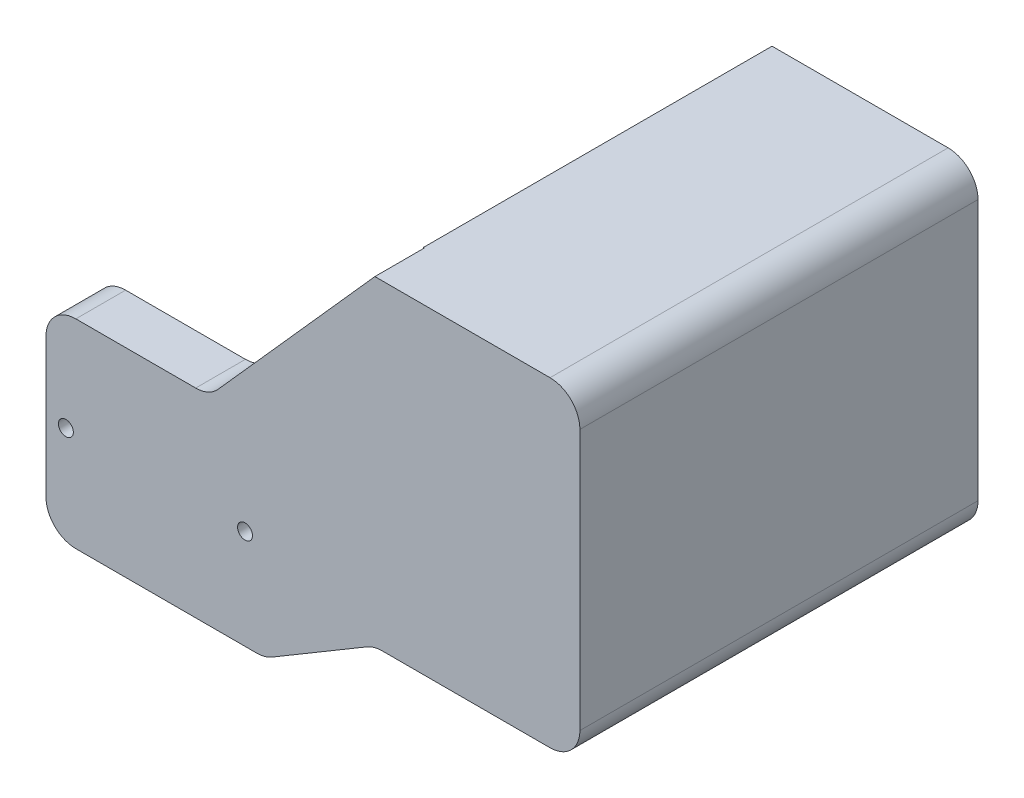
from build123d import *

# Parameters (mm, degrees)
CROQUIS1_W                 = 22
CROQUIS1_H                 = 20
SALIENTE_EXTRUIR1_DEPTH    = 30
SALIENTE_EXTRUIR1_2_DEPTH  = 30
CROQUIS3_W                 = 20.695436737
CROQUIS3_H                 = 32.204103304
SALIENTE_EXTRUIR2_DEPTH    = 5
CROQUIS4_W                 = 22
CROQUIS4_H                 = 20
CORTAR_EXTRUIR1_DEPTH      = 20
CROQUIS5_W                 = 22
CROQUIS5_H                 = 20
SALIENTE_EXTRUIR3_DEPTH    = 10
CROQUIS6_W                 = 22
CROQUIS6_H                 = 20
CORTAR_EXTRUIR2_DEPTH      = 10
CROQUIS7_W                 = 22
CROQUIS7_H                 = 20
CORTAR_EXTRUIR3_DEPTH      = 5
SALIENTE_EXTRUIR6_DEPTH    = 5
REDONDEO2_R                = 3
REDONDEO3_R                = 3
CROQUIS12_R                = 0.75
CORTAR_EXTRUIR4_DEPTH      = 7
REDONDEO4_R                = 3
REDONDEO5_R                = 3
REDONDEO6_R                = 3
REDONDEO7_R                = 3
REDONDEO8_R                = 3
CROQUIS13_R                = 0.75
SALIENTE_EXTRUIR7_DEPTH    = 5
CORTAR_EXTRUIR5_DEPTH      = 10
CORTAR_EXTRUIR5_DEPTH_BACK = 6
CROQUIS14_R                = 0.75
CROQUIS15_W                = 15.695436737
CROQUIS15_H                = 22.399714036
SALIENTE_EXTRUIR8_DEPTH    = 1.02
CROQUIS16_W                = 0.095436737
CROQUIS16_H                = 4.904389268
SALIENTE_EXTRUIR9_DEPTH    = 30.02


with BuildPart() as part:
    # Croquis1 → Saliente-Extruir1 (new body)
    with BuildSketch(Plane.XY):
        Rectangle(CROQUIS1_W, CROQUIS1_H)
    extrude(amount=-SALIENTE_EXTRUIR1_DEPTH)

    # Croquis4 → Cortar-Extruir1 (cut)
    with BuildSketch(Plane(origin=(0, 0, -30), x_dir=(-1, 0, 0), z_dir=(0, 0, -1))):
        Rectangle(CROQUIS4_W, CROQUIS4_H)
    extrude(amount=-CORTAR_EXTRUIR1_DEPTH, mode=Mode.SUBTRACT)

    # Croquis5 → Saliente-Extruir3 (add)
    with BuildSketch(Plane.XY):
        Rectangle(CROQUIS5_W, CROQUIS5_H)
    extrude(amount=SALIENTE_EXTRUIR3_DEPTH)

    # Croquis6 → Cortar-Extruir2 (cut)
    with BuildSketch(Plane(origin=(0, 0, -10), x_dir=(-1, 0, 0), z_dir=(0, 0, -1))):
        Rectangle(CROQUIS6_W, CROQUIS6_H)
    extrude(amount=-CORTAR_EXTRUIR2_DEPTH, mode=Mode.SUBTRACT)

    # Croquis7 → Cortar-Extruir3 (cut)
    with BuildSketch(Plane.XY.offset(10)):
        Rectangle(CROQUIS7_W, CROQUIS7_H)
    extrude(amount=-CORTAR_EXTRUIR3_DEPTH, mode=Mode.SUBTRACT)



with BuildPart() as body_2:
    # Croquis1 → Saliente-Extruir1 2 (new body)
    with BuildSketch(Plane.XY):
        Polygon((37.645436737, 1.4), (37.645436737, 23.799714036), (22.045436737, 23.799714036), (22.045436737, 28.704103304), (42.645436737, 28.704103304), (42.645436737, -3.5), (21.95, -3.5), (21.95, 1.4), align=None)
    extrude(amount=-SALIENTE_EXTRUIR1_2_DEPTH)

    # Croquis3 → Saliente-Extruir2 (add)
    with BuildSketch(Plane(origin=(0, 0, -30), x_dir=(-1, 0, 0), z_dir=(0, 0, -1))):
        with Locations((-32.297718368, 12.602051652)):
            Rectangle(CROQUIS3_W, CROQUIS3_H)
    extrude(amount=SALIENTE_EXTRUIR2_DEPTH)


with BuildPart() as part_1:
    add(part.part)

    add(body_2.part)  # Saliente-Extruir6 merges body 2
    # Croquis8 → Saliente-Extruir6 (add)
    with BuildSketch(Plane.XY.offset(5)):
        Polygon((11, -10), (11, -5.1), (11, 10), (5.385440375, 10), (22.045436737, 28.704103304), (42.645436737, 28.704103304), (42.645436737, -3.5), (21.95, -3.5), align=None)
    extrude(amount=-SALIENTE_EXTRUIR6_DEPTH)

    # Redondeo2
    redondeo2_edges = [part_1.edges().sort_by_distance(p)[0] for p in [
        (-11, 10, 2.5),
    ]]
    fillet(redondeo2_edges, radius=REDONDEO2_R)

    # Redondeo3
    redondeo3_edges = [part_1.edges().sort_by_distance(p)[0] for p in [
        (-11, -10, 2.5),
    ]]
    fillet(redondeo3_edges, radius=REDONDEO3_R)

    # Croquis12 → Cortar-Extruir4 (cut)
    with BuildSketch(Plane.XY.offset(5)):
        with Locations((1.5, -8)):
            Circle(CROQUIS12_R)
        with Locations((1.5, 7.997026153)):
            Circle(CROQUIS12_R)
    extrude(amount=-CORTAR_EXTRUIR4_DEPTH, mode=Mode.SUBTRACT)

    # Redondeo4
    redondeo4_edges = [part_1.edges().sort_by_distance(p)[0] for p in [
        (11, -10, 2.5),
    ]]
    fillet(redondeo4_edges, radius=REDONDEO4_R)

    # Redondeo5
    redondeo5_edges = [part_1.edges().sort_by_distance(p)[0] for p in [
        (42.645436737, -3.5, -15),
    ]]
    fillet(redondeo5_edges, radius=REDONDEO5_R)

    # Redondeo6
    redondeo6_edges = [part_1.edges().sort_by_distance(p)[0] for p in [
        (42.645436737, 28.704103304, -15),
    ]]
    fillet(redondeo6_edges, radius=REDONDEO6_R)

    # Redondeo7
    redondeo7_edges = [part_1.edges().sort_by_distance(p)[0] for p in [
        (21.95, -3.5, 2.5),
    ]]
    fillet(redondeo7_edges, radius=REDONDEO7_R)

    # Redondeo8
    redondeo8_edges = [part_1.edges().sort_by_distance(p)[0] for p in [
        (5.385440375, 10, 2.5),
    ]]
    fillet(redondeo8_edges, radius=REDONDEO8_R)

    # Croquis13 → Saliente-Extruir7 (add)
    with BuildSketch(Plane.XY.offset(5)):
        with Locations((1.5, 7.997026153)):
            Circle(CROQUIS13_R)
        with Locations((1.5, -8)):
            Circle(CROQUIS13_R)
    extrude(amount=-SALIENTE_EXTRUIR7_DEPTH)

    # Croquis14 → Cortar-Extruir5 (cut, two sides: drawn at the far end of the back side and taken through both)
    with BuildSketch(Plane.XY.offset(5).offset(-CORTAR_EXTRUIR5_DEPTH_BACK)):
        with Locations(Location((-9.002854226, 0, 0), (0, 0, 180))):
            Circle(CROQUIS14_R)
        with Locations(Location((8.997145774, 0, 0), (0, 0, 180))):
            Circle(CROQUIS14_R)
    extrude(amount=CORTAR_EXTRUIR5_DEPTH + CORTAR_EXTRUIR5_DEPTH_BACK, mode=Mode.SUBTRACT)

    # Croquis15 → Saliente-Extruir8 (add)
    with BuildSketch(Plane.XY.offset(-30)):
        with Locations((29.797718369, 12.599857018)):
            Rectangle(CROQUIS15_W, CROQUIS15_H)
    extrude(amount=SALIENTE_EXTRUIR8_DEPTH)

    # Croquis16 → Saliente-Extruir9 (add)
    with BuildSketch(Plane.XY.offset(-30)):
        with Locations((21.997718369, 26.25190867)):
            Rectangle(CROQUIS16_W, CROQUIS16_H)
    extrude(amount=SALIENTE_EXTRUIR9_DEPTH)


solid = part_1.part
